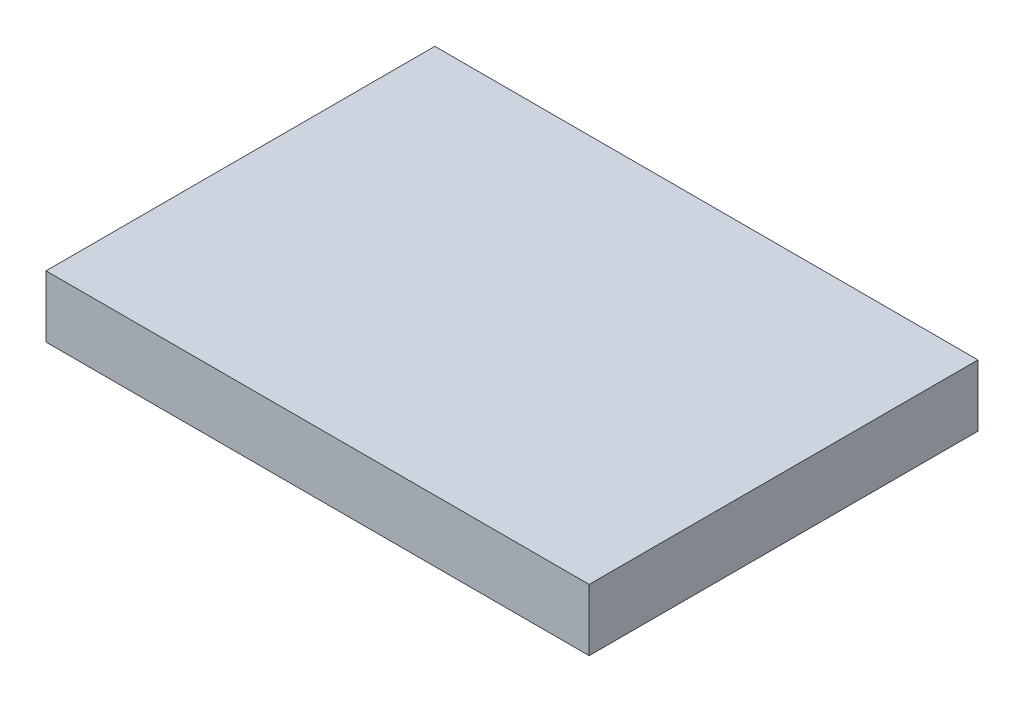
ISO-10303-21;
HEADER;
FILE_DESCRIPTION(('STEP AP214'),'2;1');
FILE_NAME('part.step','',(''),(''),'','','');
FILE_SCHEMA(('AUTOMOTIVE_DESIGN { 1 0 10303 214 1 1 1 1 }'));
ENDSEC;
DATA;
#1=APPLICATION_CONTEXT('core data for automotive mechanical design processes');
#2=APPLICATION_PROTOCOL_DEFINITION('international standard','automotive_design',2000,#1);
#3=PRODUCT_CONTEXT('',#1,'mechanical');
#4=PRODUCT('Part','Part','',(#3));
#5=PRODUCT_RELATED_PRODUCT_CATEGORY('part','',(#4));
#6=PRODUCT_DEFINITION_FORMATION('','',#4);
#7=PRODUCT_DEFINITION_CONTEXT('part definition',#1,'design');
#8=PRODUCT_DEFINITION('design','',#6,#7);
#9=PRODUCT_DEFINITION_SHAPE('','',#8);
#10=(LENGTH_UNIT() NAMED_UNIT(*) SI_UNIT(.MILLI.,.METRE.));
#11=(NAMED_UNIT(*) PLANE_ANGLE_UNIT() SI_UNIT($,.RADIAN.));
#12=(NAMED_UNIT(*) SI_UNIT($,.STERADIAN.) SOLID_ANGLE_UNIT());
#13=UNCERTAINTY_MEASURE_WITH_UNIT(LENGTH_MEASURE(1.E-05),#10,'distance_accuracy_value','');
#14=(GEOMETRIC_REPRESENTATION_CONTEXT(3) GLOBAL_UNCERTAINTY_ASSIGNED_CONTEXT((#13)) GLOBAL_UNIT_ASSIGNED_CONTEXT((#10,
#11,#12)) REPRESENTATION_CONTEXT('',''));
#15=CARTESIAN_POINT('',(0.,0.,0.));
#16=DIRECTION('',(0.,0.,1.));
#17=DIRECTION('',(1.,0.,0.));
#18=AXIS2_PLACEMENT_3D('',#15,#16,#17);
#19=CARTESIAN_POINT('',(44.,10.,31.5));
#20=DIRECTION('',(-1.,0.,0.));
#21=DIRECTION('',(0.,0.,1.));
#22=AXIS2_PLACEMENT_3D('',#19,#20,#21);
#23=PLANE('',#22);
#24=DIRECTION('',(0.,0.,-1.));
#25=VECTOR('',#24,1.);
#26=CARTESIAN_POINT('',(44.,0.,31.5));
#27=LINE('',#26,#25);
#28=CARTESIAN_POINT('',(44.,0.,31.5));
#29=VERTEX_POINT('',#28);
#30=CARTESIAN_POINT('',(44.,0.,-31.5));
#31=VERTEX_POINT('',#30);
#32=EDGE_CURVE('E113',#29,#31,#27,.T.);
#33=ORIENTED_EDGE('',*,*,#32,.T.);
#34=DIRECTION('',(0.,-1.,0.));
#35=VECTOR('',#34,1.);
#36=CARTESIAN_POINT('',(44.,10.,-31.5));
#37=LINE('',#36,#35);
#38=CARTESIAN_POINT('',(44.,10.,-31.5));
#39=VERTEX_POINT('',#38);
#40=EDGE_CURVE('E11',#39,#31,#37,.T.);
#41=ORIENTED_EDGE('',*,*,#40,.F.);
#42=DIRECTION('',(0.,0.,-1.));
#43=VECTOR('',#42,1.);
#44=CARTESIAN_POINT('',(44.,10.,31.5));
#45=LINE('',#44,#43);
#46=CARTESIAN_POINT('',(44.,10.,31.5));
#47=VERTEX_POINT('',#46);
#48=EDGE_CURVE('E97',#47,#39,#45,.T.);
#49=ORIENTED_EDGE('',*,*,#48,.F.);
#50=DIRECTION('',(0.,-1.,0.));
#51=VECTOR('',#50,1.);
#52=CARTESIAN_POINT('',(44.,10.,31.5));
#53=LINE('',#52,#51);
#54=EDGE_CURVE('E109',#47,#29,#53,.T.);
#55=ORIENTED_EDGE('',*,*,#54,.T.);
#56=EDGE_LOOP('',(#33,#41,#49,#55));
#57=FACE_BOUND('',#56,.T.);
#58=ADVANCED_FACE('F45',(#57),#23,.F.);
#59=CARTESIAN_POINT('',(-44.,10.,-31.5));
#60=DIRECTION('',(0.,0.,1.));
#61=DIRECTION('',(1.,0.,0.));
#62=AXIS2_PLACEMENT_3D('',#59,#60,#61);
#63=PLANE('',#62);
#64=DIRECTION('',(-1.,0.,0.));
#65=VECTOR('',#64,1.);
#66=CARTESIAN_POINT('',(-44.,0.,-31.5));
#67=LINE('',#66,#65);
#68=CARTESIAN_POINT('',(-44.,0.,-31.5));
#69=VERTEX_POINT('',#68);
#70=EDGE_CURVE('E102',#31,#69,#67,.T.);
#71=ORIENTED_EDGE('',*,*,#70,.T.);
#72=DIRECTION('',(0.,-1.,0.));
#73=VECTOR('',#72,1.);
#74=CARTESIAN_POINT('',(-44.,10.,-31.5));
#75=LINE('',#74,#73);
#76=CARTESIAN_POINT('',(-44.,10.,-31.5));
#77=VERTEX_POINT('',#76);
#78=EDGE_CURVE('E54',#77,#69,#75,.T.);
#79=ORIENTED_EDGE('',*,*,#78,.F.);
#80=DIRECTION('',(-1.,0.,0.));
#81=VECTOR('',#80,1.);
#82=CARTESIAN_POINT('',(-44.,10.,-31.5));
#83=LINE('',#82,#81);
#84=EDGE_CURVE('E92',#39,#77,#83,.T.);
#85=ORIENTED_EDGE('',*,*,#84,.F.);
#86=ORIENTED_EDGE('',*,*,#40,.T.);
#87=EDGE_LOOP('',(#71,#79,#85,#86));
#88=FACE_BOUND('',#87,.T.);
#89=ADVANCED_FACE('F101',(#88),#63,.F.);
#90=CARTESIAN_POINT('',(-44.,10.,31.5));
#91=DIRECTION('',(1.,0.,0.));
#92=DIRECTION('',(0.,0.,-1.));
#93=AXIS2_PLACEMENT_3D('',#90,#91,#92);
#94=PLANE('',#93);
#95=DIRECTION('',(0.,0.,1.));
#96=VECTOR('',#95,1.);
#97=CARTESIAN_POINT('',(-44.,0.,31.5));
#98=LINE('',#97,#96);
#99=CARTESIAN_POINT('',(-44.,0.,31.5));
#100=VERTEX_POINT('',#99);
#101=EDGE_CURVE('E79',#69,#100,#98,.T.);
#102=ORIENTED_EDGE('',*,*,#101,.T.);
#103=DIRECTION('',(0.,-1.,0.));
#104=VECTOR('',#103,1.);
#105=CARTESIAN_POINT('',(-44.,10.,31.5));
#106=LINE('',#105,#104);
#107=CARTESIAN_POINT('',(-44.,10.,31.5));
#108=VERTEX_POINT('',#107);
#109=EDGE_CURVE('E104',#108,#100,#106,.T.);
#110=ORIENTED_EDGE('',*,*,#109,.F.);
#111=DIRECTION('',(0.,0.,1.));
#112=VECTOR('',#111,1.);
#113=CARTESIAN_POINT('',(-44.,10.,31.5));
#114=LINE('',#113,#112);
#115=EDGE_CURVE('E95',#77,#108,#114,.T.);
#116=ORIENTED_EDGE('',*,*,#115,.F.);
#117=ORIENTED_EDGE('',*,*,#78,.T.);
#118=EDGE_LOOP('',(#102,#110,#116,#117));
#119=FACE_BOUND('',#118,.T.);
#120=ADVANCED_FACE('F105',(#119),#94,.F.);
#121=CARTESIAN_POINT('',(-44.,10.,31.5));
#122=DIRECTION('',(0.,0.,-1.));
#123=DIRECTION('',(-1.,0.,0.));
#124=AXIS2_PLACEMENT_3D('',#121,#122,#123);
#125=PLANE('',#124);
#126=DIRECTION('',(1.,0.,0.));
#127=VECTOR('',#126,1.);
#128=CARTESIAN_POINT('',(-44.,0.,31.5));
#129=LINE('',#128,#127);
#130=EDGE_CURVE('E85',#100,#29,#129,.T.);
#131=ORIENTED_EDGE('',*,*,#130,.T.);
#132=ORIENTED_EDGE('',*,*,#54,.F.);
#133=DIRECTION('',(1.,0.,0.));
#134=VECTOR('',#133,1.);
#135=CARTESIAN_POINT('',(-44.,10.,31.5));
#136=LINE('',#135,#134);
#137=EDGE_CURVE('E62',#108,#47,#136,.T.);
#138=ORIENTED_EDGE('',*,*,#137,.F.);
#139=ORIENTED_EDGE('',*,*,#109,.T.);
#140=EDGE_LOOP('',(#131,#132,#138,#139));
#141=FACE_BOUND('',#140,.T.);
#142=ADVANCED_FACE('F126',(#141),#125,.F.);
#143=CARTESIAN_POINT('',(0.,10.,0.));
#144=DIRECTION('',(0.,-1.,0.));
#145=DIRECTION('',(0.,0.,-1.));
#146=AXIS2_PLACEMENT_3D('',#143,#144,#145);
#147=PLANE('',#146);
#148=ORIENTED_EDGE('',*,*,#48,.T.);
#149=ORIENTED_EDGE('',*,*,#84,.T.);
#150=ORIENTED_EDGE('',*,*,#115,.T.);
#151=ORIENTED_EDGE('',*,*,#137,.T.);
#152=EDGE_LOOP('',(#148,#149,#150,#151));
#153=FACE_BOUND('',#152,.T.);
#154=ADVANCED_FACE('F93',(#153),#147,.F.);
#155=CARTESIAN_POINT('',(0.,0.,0.));
#156=DIRECTION('',(0.,-1.,0.));
#157=DIRECTION('',(0.,0.,-1.));
#158=AXIS2_PLACEMENT_3D('',#155,#156,#157);
#159=PLANE('',#158);
#160=ORIENTED_EDGE('',*,*,#32,.F.);
#161=ORIENTED_EDGE('',*,*,#130,.F.);
#162=ORIENTED_EDGE('',*,*,#101,.F.);
#163=ORIENTED_EDGE('',*,*,#70,.F.);
#164=EDGE_LOOP('',(#160,#161,#162,#163));
#165=FACE_BOUND('',#164,.T.);
#166=ADVANCED_FACE('F129',(#165),#159,.T.);
#167=CLOSED_SHELL('',(#58,#89,#120,#142,#154,#166));
#168=MANIFOLD_SOLID_BREP('B2',#167);
#169=ADVANCED_BREP_SHAPE_REPRESENTATION('',(#18,#168),#14);
#170=SHAPE_DEFINITION_REPRESENTATION(#9,#169);
ENDSEC;
END-ISO-10303-21;
